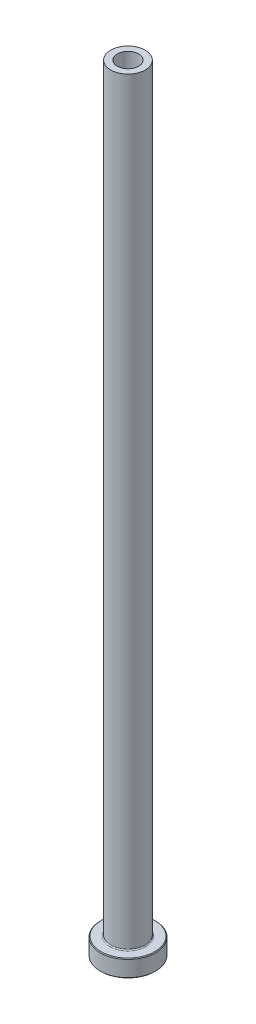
ISO-10303-21;
HEADER;
FILE_DESCRIPTION(('STEP AP214'),'2;1');
FILE_NAME('part.step','',(''),(''),'','','');
FILE_SCHEMA(('AUTOMOTIVE_DESIGN { 1 0 10303 214 1 1 1 1 }'));
ENDSEC;
DATA;
#1=APPLICATION_CONTEXT('core data for automotive mechanical design processes');
#2=APPLICATION_PROTOCOL_DEFINITION('international standard','automotive_design',2000,#1);
#3=PRODUCT_CONTEXT('',#1,'mechanical');
#4=PRODUCT('Part','Part','',(#3));
#5=PRODUCT_RELATED_PRODUCT_CATEGORY('part','',(#4));
#6=PRODUCT_DEFINITION_FORMATION('','',#4);
#7=PRODUCT_DEFINITION_CONTEXT('part definition',#1,'design');
#8=PRODUCT_DEFINITION('design','',#6,#7);
#9=PRODUCT_DEFINITION_SHAPE('','',#8);
#10=(LENGTH_UNIT() NAMED_UNIT(*) SI_UNIT(.MILLI.,.METRE.));
#11=(NAMED_UNIT(*) PLANE_ANGLE_UNIT() SI_UNIT($,.RADIAN.));
#12=(NAMED_UNIT(*) SI_UNIT($,.STERADIAN.) SOLID_ANGLE_UNIT());
#13=UNCERTAINTY_MEASURE_WITH_UNIT(LENGTH_MEASURE(1.E-05),#10,'distance_accuracy_value','');
#14=(GEOMETRIC_REPRESENTATION_CONTEXT(3) GLOBAL_UNCERTAINTY_ASSIGNED_CONTEXT((#13)) GLOBAL_UNIT_ASSIGNED_CONTEXT((#10,
#11,#12)) REPRESENTATION_CONTEXT('',''));
#15=CARTESIAN_POINT('',(0.,0.,0.));
#16=DIRECTION('',(0.,0.,1.));
#17=DIRECTION('',(1.,0.,0.));
#18=AXIS2_PLACEMENT_3D('',#15,#16,#17);
#19=CARTESIAN_POINT('',(0.,92.1876809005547,0.));
#20=DIRECTION('',(0.,1.,0.));
#21=DIRECTION('',(0.,0.,1.));
#22=AXIS2_PLACEMENT_3D('',#19,#20,#21);
#23=CYLINDRICAL_SURFACE('',#22,3.10000000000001);
#24=CARTESIAN_POINT('',(0.,225.,0.));
#25=DIRECTION('',(0.,1.,0.));
#26=DIRECTION('',(0.,0.,1.));
#27=AXIS2_PLACEMENT_3D('',#24,#25,#26);
#28=CIRCLE('',#27,3.10000000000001);
#29=CARTESIAN_POINT('',(0.,225.,3.10000000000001));
#30=VERTEX_POINT('',#29);
#31=EDGE_CURVE('E62',#30,#30,#28,.T.);
#32=ORIENTED_EDGE('',*,*,#31,.T.);
#33=EDGE_LOOP('',(#32));
#34=FACE_BOUND('',#33,.T.);
#35=CARTESIAN_POINT('',(0.,180.,0.));
#36=DIRECTION('',(0.,1.,0.));
#37=DIRECTION('',(0.,0.,1.));
#38=AXIS2_PLACEMENT_3D('',#35,#36,#37);
#39=CIRCLE('',#38,3.10000000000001);
#40=CARTESIAN_POINT('',(0.,180.,3.10000000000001));
#41=VERTEX_POINT('',#40);
#42=EDGE_CURVE('E71',#41,#41,#39,.T.);
#43=ORIENTED_EDGE('',*,*,#42,.F.);
#44=EDGE_LOOP('',(#43));
#45=FACE_BOUND('',#44,.T.);
#46=ADVANCED_FACE('F30',(#34,#45),#23,.F.);
#47=CARTESIAN_POINT('',(-3.10000000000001,225.,0.));
#48=DIRECTION('',(0.,1.,0.));
#49=DIRECTION('',(0.,0.,1.));
#50=AXIS2_PLACEMENT_3D('',#47,#48,#49);
#51=PLANE('',#50);
#52=CARTESIAN_POINT('',(0.,225.,0.));
#53=DIRECTION('',(0.,1.,0.));
#54=DIRECTION('',(0.,0.,1.));
#55=AXIS2_PLACEMENT_3D('',#52,#53,#54);
#56=CIRCLE('',#55,5.00000000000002);
#57=CARTESIAN_POINT('',(0.,225.,5.00000000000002));
#58=VERTEX_POINT('',#57);
#59=EDGE_CURVE('E65',#58,#58,#56,.T.);
#60=ORIENTED_EDGE('',*,*,#59,.T.);
#61=EDGE_LOOP('',(#60));
#62=FACE_BOUND('',#61,.T.);
#63=ORIENTED_EDGE('',*,*,#31,.F.);
#64=EDGE_LOOP('',(#63));
#65=FACE_BOUND('',#64,.T.);
#66=ADVANCED_FACE('F79',(#62,#65),#51,.T.);
#67=CARTESIAN_POINT('',(0.,92.1876809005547,0.));
#68=DIRECTION('',(0.,1.,0.));
#69=DIRECTION('',(0.,0.,1.));
#70=AXIS2_PLACEMENT_3D('',#67,#68,#69);
#71=CYLINDRICAL_SURFACE('',#70,5.);
#72=CARTESIAN_POINT('',(0.,5.3,0.));
#73=DIRECTION('',(0.,1.,0.));
#74=DIRECTION('',(0.,0.,1.));
#75=AXIS2_PLACEMENT_3D('',#72,#73,#74);
#76=CIRCLE('',#75,5.);
#77=CARTESIAN_POINT('',(0.,5.3,5.));
#78=VERTEX_POINT('',#77);
#79=EDGE_CURVE('E59',#78,#78,#76,.T.);
#80=ORIENTED_EDGE('',*,*,#79,.T.);
#81=EDGE_LOOP('',(#80));
#82=FACE_BOUND('',#81,.T.);
#83=ORIENTED_EDGE('',*,*,#59,.F.);
#84=EDGE_LOOP('',(#83));
#85=FACE_BOUND('',#84,.T.);
#86=ADVANCED_FACE('F85',(#82,#85),#71,.T.);
#87=CARTESIAN_POINT('',(-4.99999999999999,5.,0.));
#88=DIRECTION('',(0.,1.,0.));
#89=DIRECTION('',(0.,0.,1.));
#90=AXIS2_PLACEMENT_3D('',#87,#88,#89);
#91=PLANE('',#90);
#92=CARTESIAN_POINT('',(0.,5.,0.));
#93=DIRECTION('',(0.,1.,0.));
#94=DIRECTION('',(0.,0.,1.));
#95=AXIS2_PLACEMENT_3D('',#92,#93,#94);
#96=CIRCLE('',#95,7.80000000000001);
#97=CARTESIAN_POINT('',(0.,5.,7.80000000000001));
#98=VERTEX_POINT('',#97);
#99=EDGE_CURVE('E53',#98,#98,#96,.T.);
#100=ORIENTED_EDGE('',*,*,#99,.T.);
#101=EDGE_LOOP('',(#100));
#102=FACE_BOUND('',#101,.T.);
#103=CARTESIAN_POINT('',(0.,5.,0.));
#104=DIRECTION('',(0.,1.,0.));
#105=DIRECTION('',(0.,0.,1.));
#106=AXIS2_PLACEMENT_3D('',#103,#104,#105);
#107=CIRCLE('',#106,5.3);
#108=CARTESIAN_POINT('',(0.,5.,5.3));
#109=VERTEX_POINT('',#108);
#110=EDGE_CURVE('E56',#109,#109,#107,.F.);
#111=ORIENTED_EDGE('',*,*,#110,.T.);
#112=EDGE_LOOP('',(#111));
#113=FACE_BOUND('',#112,.T.);
#114=ADVANCED_FACE('F111',(#102,#113),#91,.T.);
#115=CARTESIAN_POINT('',(0.,92.1876809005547,0.));
#116=DIRECTION('',(0.,1.,0.));
#117=DIRECTION('',(0.,0.,1.));
#118=AXIS2_PLACEMENT_3D('',#115,#116,#117);
#119=CYLINDRICAL_SURFACE('',#118,7.99999999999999);
#120=CARTESIAN_POINT('',(0.,4.80000000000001,0.));
#121=DIRECTION('',(0.,1.,0.));
#122=DIRECTION('',(0.,0.,1.));
#123=AXIS2_PLACEMENT_3D('',#120,#121,#122);
#124=CIRCLE('',#123,7.99999999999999);
#125=CARTESIAN_POINT('',(0.,4.80000000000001,7.99999999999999));
#126=VERTEX_POINT('',#125);
#127=EDGE_CURVE('E45',#126,#126,#124,.F.);
#128=ORIENTED_EDGE('',*,*,#127,.T.);
#129=EDGE_LOOP('',(#128));
#130=FACE_BOUND('',#129,.T.);
#131=CARTESIAN_POINT('',(0.,0.199999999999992,0.));
#132=DIRECTION('',(0.,-1.,0.));
#133=DIRECTION('',(0.,0.,-1.));
#134=AXIS2_PLACEMENT_3D('',#131,#132,#133);
#135=CIRCLE('',#134,7.99999999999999);
#136=CARTESIAN_POINT('',(0.,0.199999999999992,-7.99999999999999));
#137=VERTEX_POINT('',#136);
#138=EDGE_CURVE('E50',#137,#137,#135,.F.);
#139=ORIENTED_EDGE('',*,*,#138,.T.);
#140=EDGE_LOOP('',(#139));
#141=FACE_BOUND('',#140,.T.);
#142=ADVANCED_FACE('F108',(#130,#141),#119,.T.);
#143=CARTESIAN_POINT('',(-7.99999999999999,0.,0.));
#144=DIRECTION('',(0.,-1.,0.));
#145=DIRECTION('',(0.,0.,-1.));
#146=AXIS2_PLACEMENT_3D('',#143,#144,#145);
#147=PLANE('',#146);
#148=CARTESIAN_POINT('',(0.,0.,0.));
#149=DIRECTION('',(0.,-1.,0.));
#150=DIRECTION('',(0.,0.,-1.));
#151=AXIS2_PLACEMENT_3D('',#148,#149,#150);
#152=CIRCLE('',#151,3.84999999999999);
#153=CARTESIAN_POINT('',(0.,0.,-3.84999999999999));
#154=VERTEX_POINT('',#153);
#155=EDGE_CURVE('E37',#154,#154,#152,.F.);
#156=ORIENTED_EDGE('',*,*,#155,.T.);
#157=EDGE_LOOP('',(#156));
#158=FACE_BOUND('',#157,.T.);
#159=CARTESIAN_POINT('',(0.,0.,0.));
#160=DIRECTION('',(0.,-1.,0.));
#161=DIRECTION('',(0.,0.,-1.));
#162=AXIS2_PLACEMENT_3D('',#159,#160,#161);
#163=CIRCLE('',#162,7.8);
#164=CARTESIAN_POINT('',(0.,0.,-7.8));
#165=VERTEX_POINT('',#164);
#166=EDGE_CURVE('E41',#165,#165,#163,.T.);
#167=ORIENTED_EDGE('',*,*,#166,.T.);
#168=EDGE_LOOP('',(#167));
#169=FACE_BOUND('',#168,.T.);
#170=ADVANCED_FACE('F110',(#158,#169),#147,.T.);
#171=CARTESIAN_POINT('',(0.,92.1876809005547,0.));
#172=DIRECTION('',(0.,1.,0.));
#173=DIRECTION('',(0.,0.,1.));
#174=AXIS2_PLACEMENT_3D('',#171,#172,#173);
#175=CYLINDRICAL_SURFACE('',#174,3.35);
#176=CARTESIAN_POINT('',(0.,0.499999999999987,0.));
#177=DIRECTION('',(0.,-1.,0.));
#178=DIRECTION('',(0.,0.,-1.));
#179=AXIS2_PLACEMENT_3D('',#176,#177,#178);
#180=CIRCLE('',#179,3.35);
#181=CARTESIAN_POINT('',(0.,0.499999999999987,-3.35));
#182=VERTEX_POINT('',#181);
#183=EDGE_CURVE('E10',#182,#182,#180,.T.);
#184=ORIENTED_EDGE('',*,*,#183,.T.);
#185=EDGE_LOOP('',(#184));
#186=FACE_BOUND('',#185,.T.);
#187=CARTESIAN_POINT('',(0.,168.,0.));
#188=DIRECTION('',(0.,1.,0.));
#189=DIRECTION('',(0.,0.,1.));
#190=AXIS2_PLACEMENT_3D('',#187,#188,#189);
#191=CIRCLE('',#190,3.35000000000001);
#192=CARTESIAN_POINT('',(0.,168.,3.35000000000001));
#193=VERTEX_POINT('',#192);
#194=EDGE_CURVE('E68',#193,#193,#191,.T.);
#195=ORIENTED_EDGE('',*,*,#194,.T.);
#196=EDGE_LOOP('',(#195));
#197=FACE_BOUND('',#196,.T.);
#198=ADVANCED_FACE('F118',(#186,#197),#175,.F.);
#199=CARTESIAN_POINT('',(0.,168.,0.));
#200=DIRECTION('',(0.,-1.,0.));
#201=DIRECTION('',(0.,0.,-1.));
#202=AXIS2_PLACEMENT_3D('',#199,#200,#201);
#203=CONICAL_SURFACE('',#202,3.35000000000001,0.0208303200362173);
#204=ORIENTED_EDGE('',*,*,#42,.T.);
#205=EDGE_LOOP('',(#204));
#206=FACE_BOUND('',#205,.T.);
#207=ORIENTED_EDGE('',*,*,#194,.F.);
#208=EDGE_LOOP('',(#207));
#209=FACE_BOUND('',#208,.T.);
#210=ADVANCED_FACE('F75',(#206,#209),#203,.F.);
#211=CARTESIAN_POINT('',(0.,5.3,0.));
#212=DIRECTION('',(0.,1.,0.));
#213=DIRECTION('',(0.,0.,1.));
#214=AXIS2_PLACEMENT_3D('',#211,#212,#213);
#215=TOROIDAL_SURFACE('',#214,5.3,0.3);
#216=ORIENTED_EDGE('',*,*,#110,.F.);
#217=EDGE_LOOP('',(#216));
#218=FACE_BOUND('',#217,.T.);
#219=ORIENTED_EDGE('',*,*,#79,.F.);
#220=EDGE_LOOP('',(#219));
#221=FACE_BOUND('',#220,.T.);
#222=ADVANCED_FACE('F90',(#218,#221),#215,.F.);
#223=CARTESIAN_POINT('',(0.,5.,0.));
#224=DIRECTION('',(0.,-1.,0.));
#225=DIRECTION('',(0.,0.,-1.));
#226=AXIS2_PLACEMENT_3D('',#223,#224,#225);
#227=CONICAL_SURFACE('',#226,7.8,0.78539816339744);
#228=ORIENTED_EDGE('',*,*,#127,.F.);
#229=EDGE_LOOP('',(#228));
#230=FACE_BOUND('',#229,.T.);
#231=ORIENTED_EDGE('',*,*,#99,.F.);
#232=EDGE_LOOP('',(#231));
#233=FACE_BOUND('',#232,.T.);
#234=ADVANCED_FACE('F93',(#230,#233),#227,.T.);
#235=CARTESIAN_POINT('',(0.,0.199999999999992,0.));
#236=DIRECTION('',(0.,1.,0.));
#237=DIRECTION('',(0.,0.,1.));
#238=AXIS2_PLACEMENT_3D('',#235,#236,#237);
#239=CONICAL_SURFACE('',#238,7.99999999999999,0.78539816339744);
#240=ORIENTED_EDGE('',*,*,#166,.F.);
#241=EDGE_LOOP('',(#240));
#242=FACE_BOUND('',#241,.T.);
#243=ORIENTED_EDGE('',*,*,#138,.F.);
#244=EDGE_LOOP('',(#243));
#245=FACE_BOUND('',#244,.T.);
#246=ADVANCED_FACE('F96',(#242,#245),#239,.T.);
#247=CARTESIAN_POINT('',(0.,0.,0.));
#248=DIRECTION('',(0.,-1.,0.));
#249=DIRECTION('',(0.,0.,-1.));
#250=AXIS2_PLACEMENT_3D('',#247,#248,#249);
#251=CONICAL_SURFACE('',#250,3.84999999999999,0.785398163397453);
#252=ORIENTED_EDGE('',*,*,#183,.F.);
#253=EDGE_LOOP('',(#252));
#254=FACE_BOUND('',#253,.T.);
#255=ORIENTED_EDGE('',*,*,#155,.F.);
#256=EDGE_LOOP('',(#255));
#257=FACE_BOUND('',#256,.T.);
#258=ADVANCED_FACE('F32',(#254,#257),#251,.F.);
#259=CLOSED_SHELL('',(#46,#66,#86,#114,#142,#170,#198,#210,#222,#234,#246,#258));
#260=MANIFOLD_SOLID_BREP('B2',#259);
#261=ADVANCED_BREP_SHAPE_REPRESENTATION('',(#18,#260),#14);
#262=SHAPE_DEFINITION_REPRESENTATION(#9,#261);
ENDSEC;
END-ISO-10303-21;
